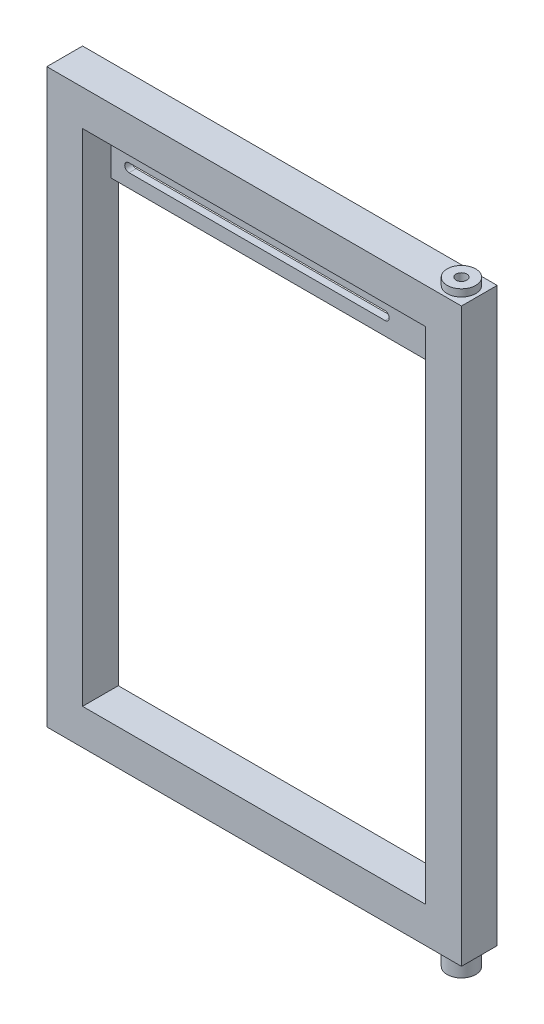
ISO-10303-21;
HEADER;
FILE_DESCRIPTION(('STEP AP214'),'2;1');
FILE_NAME('part.step','',(''),(''),'','','');
FILE_SCHEMA(('AUTOMOTIVE_DESIGN { 1 0 10303 214 1 1 1 1 }'));
ENDSEC;
DATA;
#1=APPLICATION_CONTEXT('core data for automotive mechanical design processes');
#2=APPLICATION_PROTOCOL_DEFINITION('international standard','automotive_design',2000,#1);
#3=PRODUCT_CONTEXT('',#1,'mechanical');
#4=PRODUCT('Part','Part','',(#3));
#5=PRODUCT_RELATED_PRODUCT_CATEGORY('part','',(#4));
#6=PRODUCT_DEFINITION_FORMATION('','',#4);
#7=PRODUCT_DEFINITION_CONTEXT('part definition',#1,'design');
#8=PRODUCT_DEFINITION('design','',#6,#7);
#9=PRODUCT_DEFINITION_SHAPE('','',#8);
#10=(LENGTH_UNIT() NAMED_UNIT(*) SI_UNIT(.MILLI.,.METRE.));
#11=(NAMED_UNIT(*) PLANE_ANGLE_UNIT() SI_UNIT($,.RADIAN.));
#12=(NAMED_UNIT(*) SI_UNIT($,.STERADIAN.) SOLID_ANGLE_UNIT());
#13=UNCERTAINTY_MEASURE_WITH_UNIT(LENGTH_MEASURE(1.E-05),#10,'distance_accuracy_value','');
#14=(GEOMETRIC_REPRESENTATION_CONTEXT(3) GLOBAL_UNCERTAINTY_ASSIGNED_CONTEXT((#13)) GLOBAL_UNIT_ASSIGNED_CONTEXT((#10,
#11,#12)) REPRESENTATION_CONTEXT('',''));
#15=CARTESIAN_POINT('',(0.,0.,0.));
#16=DIRECTION('',(0.,0.,1.));
#17=DIRECTION('',(1.,0.,0.));
#18=AXIS2_PLACEMENT_3D('',#15,#16,#17);
#19=CARTESIAN_POINT('',(0.,0.,50.));
#20=DIRECTION('',(0.,1.,0.));
#21=DIRECTION('',(0.,0.,1.));
#22=AXIS2_PLACEMENT_3D('',#19,#20,#21);
#23=PLANE('',#22);
#24=DIRECTION('',(1.,0.,0.));
#25=VECTOR('',#24,1.);
#26=CARTESIAN_POINT('',(0.,0.,0.));
#27=LINE('',#26,#25);
#28=CARTESIAN_POINT('',(0.,0.,0.));
#29=VERTEX_POINT('',#28);
#30=CARTESIAN_POINT('',(580.,0.,0.));
#31=VERTEX_POINT('',#30);
#32=EDGE_CURVE('E213',#29,#31,#27,.T.);
#33=ORIENTED_EDGE('',*,*,#32,.T.);
#34=DIRECTION('',(0.,0.,-1.));
#35=VECTOR('',#34,1.);
#36=CARTESIAN_POINT('',(580.,0.,50.));
#37=LINE('',#36,#35);
#38=CARTESIAN_POINT('',(580.,0.,50.));
#39=VERTEX_POINT('',#38);
#40=EDGE_CURVE('E232',#39,#31,#37,.T.);
#41=ORIENTED_EDGE('',*,*,#40,.F.);
#42=DIRECTION('',(1.,0.,0.));
#43=VECTOR('',#42,1.);
#44=CARTESIAN_POINT('',(0.,0.,50.));
#45=LINE('',#44,#43);
#46=CARTESIAN_POINT('',(0.,0.,50.));
#47=VERTEX_POINT('',#46);
#48=EDGE_CURVE('E221',#47,#39,#45,.T.);
#49=ORIENTED_EDGE('',*,*,#48,.F.);
#50=DIRECTION('',(0.,0.,-1.));
#51=VECTOR('',#50,1.);
#52=CARTESIAN_POINT('',(0.,0.,50.));
#53=LINE('',#52,#51);
#54=EDGE_CURVE('E235',#47,#29,#53,.T.);
#55=ORIENTED_EDGE('',*,*,#54,.T.);
#56=EDGE_LOOP('',(#33,#41,#49,#55));
#57=FACE_BOUND('',#56,.T.);
#58=CARTESIAN_POINT('',(555.,0.,25.));
#59=DIRECTION('',(0.,1.,0.));
#60=DIRECTION('',(0.,0.,1.));
#61=AXIS2_PLACEMENT_3D('',#58,#59,#60);
#62=CIRCLE('',#61,20.);
#63=CARTESIAN_POINT('',(555.,0.,45.));
#64=VERTEX_POINT('',#63);
#65=EDGE_CURVE('E10',#64,#64,#62,.F.);
#66=ORIENTED_EDGE('',*,*,#65,.F.);
#67=EDGE_LOOP('',(#66));
#68=FACE_BOUND('',#67,.T.);
#69=ADVANCED_FACE('F16',(#57,#68),#23,.F.);
#70=CARTESIAN_POINT('',(0.,800.,50.));
#71=DIRECTION('',(0.,-1.,0.));
#72=DIRECTION('',(0.,0.,-1.));
#73=AXIS2_PLACEMENT_3D('',#70,#71,#72);
#74=PLANE('',#73);
#75=DIRECTION('',(-1.,0.,0.));
#76=VECTOR('',#75,1.);
#77=CARTESIAN_POINT('',(0.,800.,0.));
#78=LINE('',#77,#76);
#79=CARTESIAN_POINT('',(580.,800.,0.));
#80=VERTEX_POINT('',#79);
#81=CARTESIAN_POINT('',(0.,800.,0.));
#82=VERTEX_POINT('',#81);
#83=EDGE_CURVE('E217',#80,#82,#78,.T.);
#84=ORIENTED_EDGE('',*,*,#83,.T.);
#85=DIRECTION('',(0.,0.,-1.));
#86=VECTOR('',#85,1.);
#87=CARTESIAN_POINT('',(0.,800.,50.));
#88=LINE('',#87,#86);
#89=CARTESIAN_POINT('',(0.,800.,50.));
#90=VERTEX_POINT('',#89);
#91=EDGE_CURVE('E226',#90,#82,#88,.T.);
#92=ORIENTED_EDGE('',*,*,#91,.F.);
#93=DIRECTION('',(-1.,0.,0.));
#94=VECTOR('',#93,1.);
#95=CARTESIAN_POINT('',(0.,800.,50.));
#96=LINE('',#95,#94);
#97=CARTESIAN_POINT('',(580.,800.,50.));
#98=VERTEX_POINT('',#97);
#99=EDGE_CURVE('E43',#98,#90,#96,.T.);
#100=ORIENTED_EDGE('',*,*,#99,.F.);
#101=DIRECTION('',(0.,0.,-1.));
#102=VECTOR('',#101,1.);
#103=CARTESIAN_POINT('',(580.,800.,50.));
#104=LINE('',#103,#102);
#105=EDGE_CURVE('E229',#98,#80,#104,.T.);
#106=ORIENTED_EDGE('',*,*,#105,.T.);
#107=EDGE_LOOP('',(#84,#92,#100,#106));
#108=FACE_BOUND('',#107,.T.);
#109=CARTESIAN_POINT('',(555.,800.,25.));
#110=DIRECTION('',(0.,-1.,0.));
#111=DIRECTION('',(0.,0.,-1.));
#112=AXIS2_PLACEMENT_3D('',#109,#110,#111);
#113=CIRCLE('',#112,20.);
#114=CARTESIAN_POINT('',(555.,800.,5.));
#115=VERTEX_POINT('',#114);
#116=EDGE_CURVE('E24',#115,#115,#113,.F.);
#117=ORIENTED_EDGE('',*,*,#116,.F.);
#118=EDGE_LOOP('',(#117));
#119=FACE_BOUND('',#118,.T.);
#120=ADVANCED_FACE('F242',(#108,#119),#74,.F.);
#121=CARTESIAN_POINT('',(50.,50.,50.));
#122=DIRECTION('',(1.,0.,0.));
#123=DIRECTION('',(0.,0.,-1.));
#124=AXIS2_PLACEMENT_3D('',#121,#122,#123);
#125=PLANE('',#124);
#126=DIRECTION('',(0.,0.,-1.));
#127=VECTOR('',#126,1.);
#128=CARTESIAN_POINT('',(50.,670.,10.));
#129=LINE('',#128,#127);
#130=CARTESIAN_POINT('',(50.,670.,10.));
#131=VERTEX_POINT('',#130);
#132=CARTESIAN_POINT('',(50.,670.,0.));
#133=VERTEX_POINT('',#132);
#134=EDGE_CURVE('E183',#131,#133,#129,.T.);
#135=ORIENTED_EDGE('',*,*,#134,.F.);
#136=DIRECTION('',(0.,-1.,0.));
#137=VECTOR('',#136,1.);
#138=CARTESIAN_POINT('',(50.,750.,10.));
#139=LINE('',#138,#137);
#140=CARTESIAN_POINT('',(50.,750.,10.));
#141=VERTEX_POINT('',#140);
#142=EDGE_CURVE('E176',#141,#131,#139,.T.);
#143=ORIENTED_EDGE('',*,*,#142,.F.);
#144=DIRECTION('',(0.,0.,-1.));
#145=VECTOR('',#144,1.);
#146=CARTESIAN_POINT('',(50.,750.,50.));
#147=LINE('',#146,#145);
#148=CARTESIAN_POINT('',(50.,750.,50.));
#149=VERTEX_POINT('',#148);
#150=EDGE_CURVE('E201',#149,#141,#147,.T.);
#151=ORIENTED_EDGE('',*,*,#150,.F.);
#152=DIRECTION('',(0.,-1.,0.));
#153=VECTOR('',#152,1.);
#154=CARTESIAN_POINT('',(50.,50.,50.));
#155=LINE('',#154,#153);
#156=CARTESIAN_POINT('',(50.,50.,50.));
#157=VERTEX_POINT('',#156);
#158=EDGE_CURVE('E193',#149,#157,#155,.T.);
#159=ORIENTED_EDGE('',*,*,#158,.T.);
#160=DIRECTION('',(0.,0.,-1.));
#161=VECTOR('',#160,1.);
#162=CARTESIAN_POINT('',(50.,50.,50.));
#163=LINE('',#162,#161);
#164=CARTESIAN_POINT('',(50.,50.,0.));
#165=VERTEX_POINT('',#164);
#166=EDGE_CURVE('E207',#157,#165,#163,.T.);
#167=ORIENTED_EDGE('',*,*,#166,.T.);
#168=DIRECTION('',(0.,-1.,0.));
#169=VECTOR('',#168,1.);
#170=CARTESIAN_POINT('',(50.,50.,0.));
#171=LINE('',#170,#169);
#172=EDGE_CURVE('E185',#133,#165,#171,.T.);
#173=ORIENTED_EDGE('',*,*,#172,.F.);
#174=EDGE_LOOP('',(#135,#143,#151,#159,#167,#173));
#175=FACE_BOUND('',#174,.T.);
#176=ADVANCED_FACE('F244',(#175),#125,.T.);
#177=CARTESIAN_POINT('',(530.,50.,50.));
#178=DIRECTION('',(-1.,0.,0.));
#179=DIRECTION('',(0.,0.,1.));
#180=AXIS2_PLACEMENT_3D('',#177,#178,#179);
#181=PLANE('',#180);
#182=DIRECTION('',(0.,0.,-1.));
#183=VECTOR('',#182,1.);
#184=CARTESIAN_POINT('',(530.,750.,50.));
#185=LINE('',#184,#183);
#186=CARTESIAN_POINT('',(530.,750.,50.));
#187=VERTEX_POINT('',#186);
#188=CARTESIAN_POINT('',(530.,750.,10.));
#189=VERTEX_POINT('',#188);
#190=EDGE_CURVE('E31',#187,#189,#185,.T.);
#191=ORIENTED_EDGE('',*,*,#190,.T.);
#192=DIRECTION('',(0.,1.,0.));
#193=VECTOR('',#192,1.);
#194=CARTESIAN_POINT('',(530.,750.,10.));
#195=LINE('',#194,#193);
#196=CARTESIAN_POINT('',(530.,670.,10.));
#197=VERTEX_POINT('',#196);
#198=EDGE_CURVE('E172',#197,#189,#195,.T.);
#199=ORIENTED_EDGE('',*,*,#198,.F.);
#200=DIRECTION('',(0.,0.,-1.));
#201=VECTOR('',#200,1.);
#202=CARTESIAN_POINT('',(530.,670.,10.));
#203=LINE('',#202,#201);
#204=CARTESIAN_POINT('',(530.,670.,0.));
#205=VERTEX_POINT('',#204);
#206=EDGE_CURVE('E180',#197,#205,#203,.T.);
#207=ORIENTED_EDGE('',*,*,#206,.T.);
#208=DIRECTION('',(0.,1.,0.));
#209=VECTOR('',#208,1.);
#210=CARTESIAN_POINT('',(530.,50.,0.));
#211=LINE('',#210,#209);
#212=CARTESIAN_POINT('',(530.,50.,0.));
#213=VERTEX_POINT('',#212);
#214=EDGE_CURVE('E190',#213,#205,#211,.T.);
#215=ORIENTED_EDGE('',*,*,#214,.F.);
#216=DIRECTION('',(0.,0.,-1.));
#217=VECTOR('',#216,1.);
#218=CARTESIAN_POINT('',(530.,50.,50.));
#219=LINE('',#218,#217);
#220=CARTESIAN_POINT('',(530.,50.,50.));
#221=VERTEX_POINT('',#220);
#222=EDGE_CURVE('E205',#221,#213,#219,.T.);
#223=ORIENTED_EDGE('',*,*,#222,.F.);
#224=DIRECTION('',(0.,1.,0.));
#225=VECTOR('',#224,1.);
#226=CARTESIAN_POINT('',(530.,50.,50.));
#227=LINE('',#226,#225);
#228=EDGE_CURVE('E197',#221,#187,#227,.T.);
#229=ORIENTED_EDGE('',*,*,#228,.T.);
#230=EDGE_LOOP('',(#191,#199,#207,#215,#223,#229));
#231=FACE_BOUND('',#230,.T.);
#232=ADVANCED_FACE('F251',(#231),#181,.T.);
#233=CARTESIAN_POINT('',(50.,750.,50.));
#234=DIRECTION('',(0.,-1.,0.));
#235=DIRECTION('',(0.,0.,-1.));
#236=AXIS2_PLACEMENT_3D('',#233,#234,#235);
#237=PLANE('',#236);
#238=ORIENTED_EDGE('',*,*,#150,.T.);
#239=DIRECTION('',(-1.,0.,0.));
#240=VECTOR('',#239,1.);
#241=CARTESIAN_POINT('',(530.,750.,10.));
#242=LINE('',#241,#240);
#243=EDGE_CURVE('E174',#189,#141,#242,.T.);
#244=ORIENTED_EDGE('',*,*,#243,.F.);
#245=ORIENTED_EDGE('',*,*,#190,.F.);
#246=DIRECTION('',(-1.,0.,0.));
#247=VECTOR('',#246,1.);
#248=CARTESIAN_POINT('',(50.,750.,50.));
#249=LINE('',#248,#247);
#250=EDGE_CURVE('E199',#187,#149,#249,.T.);
#251=ORIENTED_EDGE('',*,*,#250,.T.);
#252=EDGE_LOOP('',(#238,#244,#245,#251));
#253=FACE_BOUND('',#252,.T.);
#254=ADVANCED_FACE('F326',(#253),#237,.T.);
#255=CARTESIAN_POINT('',(0.,800.,50.));
#256=DIRECTION('',(0.,0.,-1.));
#257=DIRECTION('',(-1.,0.,0.));
#258=AXIS2_PLACEMENT_3D('',#255,#256,#257);
#259=PLANE('',#258);
#260=DIRECTION('',(0.,-1.,0.));
#261=VECTOR('',#260,1.);
#262=CARTESIAN_POINT('',(0.,0.,50.));
#263=LINE('',#262,#261);
#264=EDGE_CURVE('E219',#90,#47,#263,.T.);
#265=ORIENTED_EDGE('',*,*,#264,.T.);
#266=ORIENTED_EDGE('',*,*,#48,.T.);
#267=DIRECTION('',(0.,1.,0.));
#268=VECTOR('',#267,1.);
#269=CARTESIAN_POINT('',(580.,0.,50.));
#270=LINE('',#269,#268);
#271=EDGE_CURVE('E223',#39,#98,#270,.T.);
#272=ORIENTED_EDGE('',*,*,#271,.T.);
#273=ORIENTED_EDGE('',*,*,#99,.T.);
#274=EDGE_LOOP('',(#265,#266,#272,#273));
#275=FACE_BOUND('',#274,.T.);
#276=ORIENTED_EDGE('',*,*,#158,.F.);
#277=ORIENTED_EDGE('',*,*,#250,.F.);
#278=ORIENTED_EDGE('',*,*,#228,.F.);
#279=DIRECTION('',(1.,0.,0.));
#280=VECTOR('',#279,1.);
#281=CARTESIAN_POINT('',(50.,50.,50.));
#282=LINE('',#281,#280);
#283=EDGE_CURVE('E195',#157,#221,#282,.T.);
#284=ORIENTED_EDGE('',*,*,#283,.F.);
#285=EDGE_LOOP('',(#276,#277,#278,#284));
#286=FACE_BOUND('',#285,.T.);
#287=ADVANCED_FACE('F258',(#275,#286),#259,.F.);
#288=CARTESIAN_POINT('',(0.,800.,0.));
#289=DIRECTION('',(0.,0.,-1.));
#290=DIRECTION('',(-1.,0.,0.));
#291=AXIS2_PLACEMENT_3D('',#288,#289,#290);
#292=PLANE('',#291);
#293=DIRECTION('',(1.,0.,0.));
#294=VECTOR('',#293,1.);
#295=CARTESIAN_POINT('',(530.,670.,0.));
#296=LINE('',#295,#294);
#297=EDGE_CURVE('E143',#133,#205,#296,.T.);
#298=ORIENTED_EDGE('',*,*,#297,.F.);
#299=ORIENTED_EDGE('',*,*,#172,.T.);
#300=DIRECTION('',(1.,0.,0.));
#301=VECTOR('',#300,1.);
#302=CARTESIAN_POINT('',(50.,50.,0.));
#303=LINE('',#302,#301);
#304=EDGE_CURVE('E187',#165,#213,#303,.T.);
#305=ORIENTED_EDGE('',*,*,#304,.T.);
#306=ORIENTED_EDGE('',*,*,#214,.T.);
#307=EDGE_LOOP('',(#298,#299,#305,#306));
#308=FACE_BOUND('',#307,.T.);
#309=DIRECTION('',(0.,-1.,0.));
#310=VECTOR('',#309,1.);
#311=CARTESIAN_POINT('',(0.,0.,0.));
#312=LINE('',#311,#310);
#313=EDGE_CURVE('E210',#82,#29,#312,.T.);
#314=ORIENTED_EDGE('',*,*,#313,.F.);
#315=ORIENTED_EDGE('',*,*,#83,.F.);
#316=DIRECTION('',(0.,1.,0.));
#317=VECTOR('',#316,1.);
#318=CARTESIAN_POINT('',(580.,0.,0.));
#319=LINE('',#318,#317);
#320=EDGE_CURVE('E215',#31,#80,#319,.T.);
#321=ORIENTED_EDGE('',*,*,#320,.F.);
#322=ORIENTED_EDGE('',*,*,#32,.F.);
#323=EDGE_LOOP('',(#314,#315,#321,#322));
#324=FACE_BOUND('',#323,.T.);
#325=DIRECTION('',(-1.,0.,0.));
#326=VECTOR('',#325,1.);
#327=CARTESIAN_POINT('',(75.,701.,0.));
#328=LINE('',#327,#326);
#329=CARTESIAN_POINT('',(433.,701.,0.));
#330=VERTEX_POINT('',#329);
#331=CARTESIAN_POINT('',(75.,701.,0.));
#332=VERTEX_POINT('',#331);
#333=EDGE_CURVE('E148',#330,#332,#328,.T.);
#334=ORIENTED_EDGE('',*,*,#333,.T.);
#335=CARTESIAN_POINT('',(75.,695.,0.));
#336=DIRECTION('',(0.,0.,1.));
#337=DIRECTION('',(1.,0.,0.));
#338=AXIS2_PLACEMENT_3D('',#335,#336,#337);
#339=CIRCLE('',#338,6.);
#340=CARTESIAN_POINT('',(75.,689.,0.));
#341=VERTEX_POINT('',#340);
#342=EDGE_CURVE('E135',#332,#341,#339,.T.);
#343=ORIENTED_EDGE('',*,*,#342,.T.);
#344=DIRECTION('',(1.,0.,0.));
#345=VECTOR('',#344,1.);
#346=CARTESIAN_POINT('',(75.,689.,0.));
#347=LINE('',#346,#345);
#348=CARTESIAN_POINT('',(433.,689.,0.));
#349=VERTEX_POINT('',#348);
#350=EDGE_CURVE('E123',#341,#349,#347,.T.);
#351=ORIENTED_EDGE('',*,*,#350,.T.);
#352=CARTESIAN_POINT('',(433.,695.,0.));
#353=DIRECTION('',(0.,0.,1.));
#354=DIRECTION('',(1.,0.,0.));
#355=AXIS2_PLACEMENT_3D('',#352,#353,#354);
#356=CIRCLE('',#355,6.);
#357=EDGE_CURVE('E134',#349,#330,#356,.T.);
#358=ORIENTED_EDGE('',*,*,#357,.T.);
#359=EDGE_LOOP('',(#334,#343,#351,#358));
#360=FACE_BOUND('',#359,.T.);
#361=ADVANCED_FACE('F146',(#308,#324,#360),#292,.T.);
#362=CARTESIAN_POINT('',(0.,0.,50.));
#363=DIRECTION('',(1.,0.,0.));
#364=DIRECTION('',(0.,0.,-1.));
#365=AXIS2_PLACEMENT_3D('',#362,#363,#364);
#366=PLANE('',#365);
#367=ORIENTED_EDGE('',*,*,#313,.T.);
#368=ORIENTED_EDGE('',*,*,#54,.F.);
#369=ORIENTED_EDGE('',*,*,#264,.F.);
#370=ORIENTED_EDGE('',*,*,#91,.T.);
#371=EDGE_LOOP('',(#367,#368,#369,#370));
#372=FACE_BOUND('',#371,.T.);
#373=ADVANCED_FACE('F18',(#372),#366,.F.);
#374=CARTESIAN_POINT('',(580.,0.,50.));
#375=DIRECTION('',(-1.,0.,0.));
#376=DIRECTION('',(0.,0.,1.));
#377=AXIS2_PLACEMENT_3D('',#374,#375,#376);
#378=PLANE('',#377);
#379=ORIENTED_EDGE('',*,*,#320,.T.);
#380=ORIENTED_EDGE('',*,*,#105,.F.);
#381=ORIENTED_EDGE('',*,*,#271,.F.);
#382=ORIENTED_EDGE('',*,*,#40,.T.);
#383=EDGE_LOOP('',(#379,#380,#381,#382));
#384=FACE_BOUND('',#383,.T.);
#385=ADVANCED_FACE('F260',(#384),#378,.F.);
#386=CARTESIAN_POINT('',(50.,50.,50.));
#387=DIRECTION('',(0.,1.,0.));
#388=DIRECTION('',(0.,0.,1.));
#389=AXIS2_PLACEMENT_3D('',#386,#387,#388);
#390=PLANE('',#389);
#391=ORIENTED_EDGE('',*,*,#304,.F.);
#392=ORIENTED_EDGE('',*,*,#166,.F.);
#393=ORIENTED_EDGE('',*,*,#283,.T.);
#394=ORIENTED_EDGE('',*,*,#222,.T.);
#395=EDGE_LOOP('',(#391,#392,#393,#394));
#396=FACE_BOUND('',#395,.T.);
#397=ADVANCED_FACE('F262',(#396),#390,.T.);
#398=CARTESIAN_POINT('',(530.,750.,10.));
#399=DIRECTION('',(0.,0.,-1.));
#400=DIRECTION('',(-1.,0.,0.));
#401=AXIS2_PLACEMENT_3D('',#398,#399,#400);
#402=PLANE('',#401);
#403=ORIENTED_EDGE('',*,*,#198,.T.);
#404=ORIENTED_EDGE('',*,*,#243,.T.);
#405=ORIENTED_EDGE('',*,*,#142,.T.);
#406=DIRECTION('',(1.,0.,0.));
#407=VECTOR('',#406,1.);
#408=CARTESIAN_POINT('',(530.,670.,10.));
#409=LINE('',#408,#407);
#410=EDGE_CURVE('E178',#131,#197,#409,.T.);
#411=ORIENTED_EDGE('',*,*,#410,.T.);
#412=EDGE_LOOP('',(#403,#404,#405,#411));
#413=FACE_BOUND('',#412,.T.);
#414=CARTESIAN_POINT('',(75.,695.,10.));
#415=DIRECTION('',(0.,0.,1.));
#416=DIRECTION('',(1.,0.,0.));
#417=AXIS2_PLACEMENT_3D('',#414,#415,#416);
#418=CIRCLE('',#417,6.);
#419=CARTESIAN_POINT('',(75.,701.,10.));
#420=VERTEX_POINT('',#419);
#421=CARTESIAN_POINT('',(75.,689.,10.));
#422=VERTEX_POINT('',#421);
#423=EDGE_CURVE('E142',#420,#422,#418,.T.);
#424=ORIENTED_EDGE('',*,*,#423,.F.);
#425=DIRECTION('',(-1.,0.,0.));
#426=VECTOR('',#425,1.);
#427=CARTESIAN_POINT('',(75.,701.,10.));
#428=LINE('',#427,#426);
#429=CARTESIAN_POINT('',(433.,701.,10.));
#430=VERTEX_POINT('',#429);
#431=EDGE_CURVE('E164',#430,#420,#428,.T.);
#432=ORIENTED_EDGE('',*,*,#431,.F.);
#433=CARTESIAN_POINT('',(433.,695.,10.));
#434=DIRECTION('',(0.,0.,1.));
#435=DIRECTION('',(1.,0.,0.));
#436=AXIS2_PLACEMENT_3D('',#433,#434,#435);
#437=CIRCLE('',#436,6.);
#438=CARTESIAN_POINT('',(433.,689.,10.));
#439=VERTEX_POINT('',#438);
#440=EDGE_CURVE('E161',#439,#430,#437,.T.);
#441=ORIENTED_EDGE('',*,*,#440,.F.);
#442=DIRECTION('',(1.,0.,0.));
#443=VECTOR('',#442,1.);
#444=CARTESIAN_POINT('',(75.,689.,10.));
#445=LINE('',#444,#443);
#446=EDGE_CURVE('E159',#422,#439,#445,.T.);
#447=ORIENTED_EDGE('',*,*,#446,.F.);
#448=EDGE_LOOP('',(#424,#432,#441,#447));
#449=FACE_BOUND('',#448,.T.);
#450=ADVANCED_FACE('F267',(#413,#449),#402,.F.);
#451=CARTESIAN_POINT('',(530.,670.,10.));
#452=DIRECTION('',(0.,1.,0.));
#453=DIRECTION('',(-1.,0.,0.));
#454=AXIS2_PLACEMENT_3D('',#451,#452,#453);
#455=PLANE('',#454);
#456=ORIENTED_EDGE('',*,*,#297,.T.);
#457=ORIENTED_EDGE('',*,*,#206,.F.);
#458=ORIENTED_EDGE('',*,*,#410,.F.);
#459=ORIENTED_EDGE('',*,*,#134,.T.);
#460=EDGE_LOOP('',(#456,#457,#458,#459));
#461=FACE_BOUND('',#460,.T.);
#462=ADVANCED_FACE('F319',(#461),#455,.F.);
#463=CARTESIAN_POINT('',(75.,695.,10.));
#464=DIRECTION('',(0.,0.,-1.));
#465=DIRECTION('',(-1.,0.,0.));
#466=AXIS2_PLACEMENT_3D('',#463,#464,#465);
#467=CYLINDRICAL_SURFACE('',#466,6.);
#468=ORIENTED_EDGE('',*,*,#342,.F.);
#469=DIRECTION('',(0.,0.,-1.));
#470=VECTOR('',#469,1.);
#471=CARTESIAN_POINT('',(75.,701.,10.));
#472=LINE('',#471,#470);
#473=EDGE_CURVE('E166',#420,#332,#472,.T.);
#474=ORIENTED_EDGE('',*,*,#473,.F.);
#475=ORIENTED_EDGE('',*,*,#423,.T.);
#476=DIRECTION('',(0.,0.,-1.));
#477=VECTOR('',#476,1.);
#478=CARTESIAN_POINT('',(75.,689.,10.));
#479=LINE('',#478,#477);
#480=EDGE_CURVE('E126',#422,#341,#479,.T.);
#481=ORIENTED_EDGE('',*,*,#480,.T.);
#482=EDGE_LOOP('',(#468,#474,#475,#481));
#483=FACE_BOUND('',#482,.T.);
#484=ADVANCED_FACE('F138',(#483),#467,.F.);
#485=CARTESIAN_POINT('',(75.,689.,10.));
#486=DIRECTION('',(0.,1.,0.));
#487=DIRECTION('',(0.,0.,1.));
#488=AXIS2_PLACEMENT_3D('',#485,#486,#487);
#489=PLANE('',#488);
#490=ORIENTED_EDGE('',*,*,#350,.F.);
#491=ORIENTED_EDGE('',*,*,#480,.F.);
#492=ORIENTED_EDGE('',*,*,#446,.T.);
#493=DIRECTION('',(0.,0.,-1.));
#494=VECTOR('',#493,1.);
#495=CARTESIAN_POINT('',(433.,689.,10.));
#496=LINE('',#495,#494);
#497=EDGE_CURVE('E129',#439,#349,#496,.T.);
#498=ORIENTED_EDGE('',*,*,#497,.T.);
#499=EDGE_LOOP('',(#490,#491,#492,#498));
#500=FACE_BOUND('',#499,.T.);
#501=ADVANCED_FACE('F125',(#500),#489,.T.);
#502=CARTESIAN_POINT('',(433.,695.,10.));
#503=DIRECTION('',(0.,0.,-1.));
#504=DIRECTION('',(-1.,0.,0.));
#505=AXIS2_PLACEMENT_3D('',#502,#503,#504);
#506=CYLINDRICAL_SURFACE('',#505,6.);
#507=ORIENTED_EDGE('',*,*,#357,.F.);
#508=ORIENTED_EDGE('',*,*,#497,.F.);
#509=ORIENTED_EDGE('',*,*,#440,.T.);
#510=DIRECTION('',(0.,0.,-1.));
#511=VECTOR('',#510,1.);
#512=CARTESIAN_POINT('',(433.,701.,10.));
#513=LINE('',#512,#511);
#514=EDGE_CURVE('E168',#430,#330,#513,.T.);
#515=ORIENTED_EDGE('',*,*,#514,.T.);
#516=EDGE_LOOP('',(#507,#508,#509,#515));
#517=FACE_BOUND('',#516,.T.);
#518=ADVANCED_FACE('F310',(#517),#506,.F.);
#519=CARTESIAN_POINT('',(75.,701.,10.));
#520=DIRECTION('',(0.,-1.,0.));
#521=DIRECTION('',(0.,0.,-1.));
#522=AXIS2_PLACEMENT_3D('',#519,#520,#521);
#523=PLANE('',#522);
#524=ORIENTED_EDGE('',*,*,#333,.F.);
#525=ORIENTED_EDGE('',*,*,#514,.F.);
#526=ORIENTED_EDGE('',*,*,#431,.T.);
#527=ORIENTED_EDGE('',*,*,#473,.T.);
#528=EDGE_LOOP('',(#524,#525,#526,#527));
#529=FACE_BOUND('',#528,.T.);
#530=ADVANCED_FACE('F306',(#529),#523,.T.);
#531=CARTESIAN_POINT('',(555.,810.,25.));
#532=DIRECTION('',(0.,-1.,0.));
#533=DIRECTION('',(0.,0.,-1.));
#534=AXIS2_PLACEMENT_3D('',#531,#532,#533);
#535=CYLINDRICAL_SURFACE('',#534,20.);
#536=CARTESIAN_POINT('',(555.,810.,25.));
#537=DIRECTION('',(0.,1.,0.));
#538=DIRECTION('',(0.,0.,1.));
#539=AXIS2_PLACEMENT_3D('',#536,#537,#538);
#540=CIRCLE('',#539,20.);
#541=CARTESIAN_POINT('',(555.,810.,45.));
#542=VERTEX_POINT('',#541);
#543=EDGE_CURVE('E149',#542,#542,#540,.T.);
#544=ORIENTED_EDGE('',*,*,#543,.F.);
#545=EDGE_LOOP('',(#544));
#546=FACE_BOUND('',#545,.T.);
#547=ORIENTED_EDGE('',*,*,#116,.T.);
#548=EDGE_LOOP('',(#547));
#549=FACE_BOUND('',#548,.T.);
#550=ADVANCED_FACE('F240',(#546,#549),#535,.T.);
#551=CARTESIAN_POINT('',(555.,810.,25.));
#552=DIRECTION('',(0.,1.,0.));
#553=DIRECTION('',(0.,0.,1.));
#554=AXIS2_PLACEMENT_3D('',#551,#552,#553);
#555=PLANE('',#554);
#556=CARTESIAN_POINT('',(555.,810.,25.));
#557=DIRECTION('',(0.,1.,0.));
#558=DIRECTION('',(0.,0.,1.));
#559=AXIS2_PLACEMENT_3D('',#556,#557,#558);
#560=CIRCLE('',#559,7.5);
#561=CARTESIAN_POINT('',(555.,810.,32.5));
#562=VERTEX_POINT('',#561);
#563=EDGE_CURVE('E465',#562,#562,#560,.T.);
#564=ORIENTED_EDGE('',*,*,#563,.F.);
#565=EDGE_LOOP('',(#564));
#566=FACE_BOUND('',#565,.T.);
#567=ORIENTED_EDGE('',*,*,#543,.T.);
#568=EDGE_LOOP('',(#567));
#569=FACE_BOUND('',#568,.T.);
#570=ADVANCED_FACE('F288',(#566,#569),#555,.T.);
#571=CARTESIAN_POINT('',(555.,-25.,25.));
#572=DIRECTION('',(0.,1.,0.));
#573=DIRECTION('',(0.,0.,1.));
#574=AXIS2_PLACEMENT_3D('',#571,#572,#573);
#575=CYLINDRICAL_SURFACE('',#574,20.);
#576=CARTESIAN_POINT('',(555.,-25.,25.));
#577=DIRECTION('',(0.,-1.,0.));
#578=DIRECTION('',(0.,0.,-1.));
#579=AXIS2_PLACEMENT_3D('',#576,#577,#578);
#580=CIRCLE('',#579,20.);
#581=CARTESIAN_POINT('',(555.,-25.,5.));
#582=VERTEX_POINT('',#581);
#583=EDGE_CURVE('E152',#582,#582,#580,.T.);
#584=ORIENTED_EDGE('',*,*,#583,.F.);
#585=EDGE_LOOP('',(#584));
#586=FACE_BOUND('',#585,.T.);
#587=ORIENTED_EDGE('',*,*,#65,.T.);
#588=EDGE_LOOP('',(#587));
#589=FACE_BOUND('',#588,.T.);
#590=ADVANCED_FACE('F285',(#586,#589),#575,.T.);
#591=CARTESIAN_POINT('',(555.,-25.,25.));
#592=DIRECTION('',(0.,-1.,0.));
#593=DIRECTION('',(0.,0.,-1.));
#594=AXIS2_PLACEMENT_3D('',#591,#592,#593);
#595=PLANE('',#594);
#596=CARTESIAN_POINT('',(555.,-25.,25.));
#597=DIRECTION('',(0.,1.,0.));
#598=DIRECTION('',(0.,0.,1.));
#599=AXIS2_PLACEMENT_3D('',#596,#597,#598);
#600=CIRCLE('',#599,7.5);
#601=CARTESIAN_POINT('',(555.,-25.,32.5));
#602=VERTEX_POINT('',#601);
#603=EDGE_CURVE('E462',#602,#602,#600,.T.);
#604=ORIENTED_EDGE('',*,*,#603,.T.);
#605=EDGE_LOOP('',(#604));
#606=FACE_BOUND('',#605,.T.);
#607=ORIENTED_EDGE('',*,*,#583,.T.);
#608=EDGE_LOOP('',(#607));
#609=FACE_BOUND('',#608,.T.);
#610=ADVANCED_FACE('F287',(#606,#609),#595,.T.);
#611=CARTESIAN_POINT('',(555.,-25.,25.));
#612=DIRECTION('',(0.,1.,0.));
#613=DIRECTION('',(0.,0.,1.));
#614=AXIS2_PLACEMENT_3D('',#611,#612,#613);
#615=CYLINDRICAL_SURFACE('',#614,7.5);
#616=ORIENTED_EDGE('',*,*,#603,.F.);
#617=EDGE_LOOP('',(#616));
#618=FACE_BOUND('',#617,.T.);
#619=ORIENTED_EDGE('',*,*,#563,.T.);
#620=EDGE_LOOP('',(#619));
#621=FACE_BOUND('',#620,.T.);
#622=ADVANCED_FACE('F296',(#618,#621),#615,.F.);
#623=CLOSED_SHELL('',(#69,#120,#176,#232,#254,#287,#361,#373,#385,#397,#450,#462,#484,#501,#518,
#530,#550,#570,#590,#610,#622));
#624=MANIFOLD_SOLID_BREP('B1',#623);
#625=ADVANCED_BREP_SHAPE_REPRESENTATION('',(#18,#624),#14);
#626=SHAPE_DEFINITION_REPRESENTATION(#9,#625);
ENDSEC;
END-ISO-10303-21;
